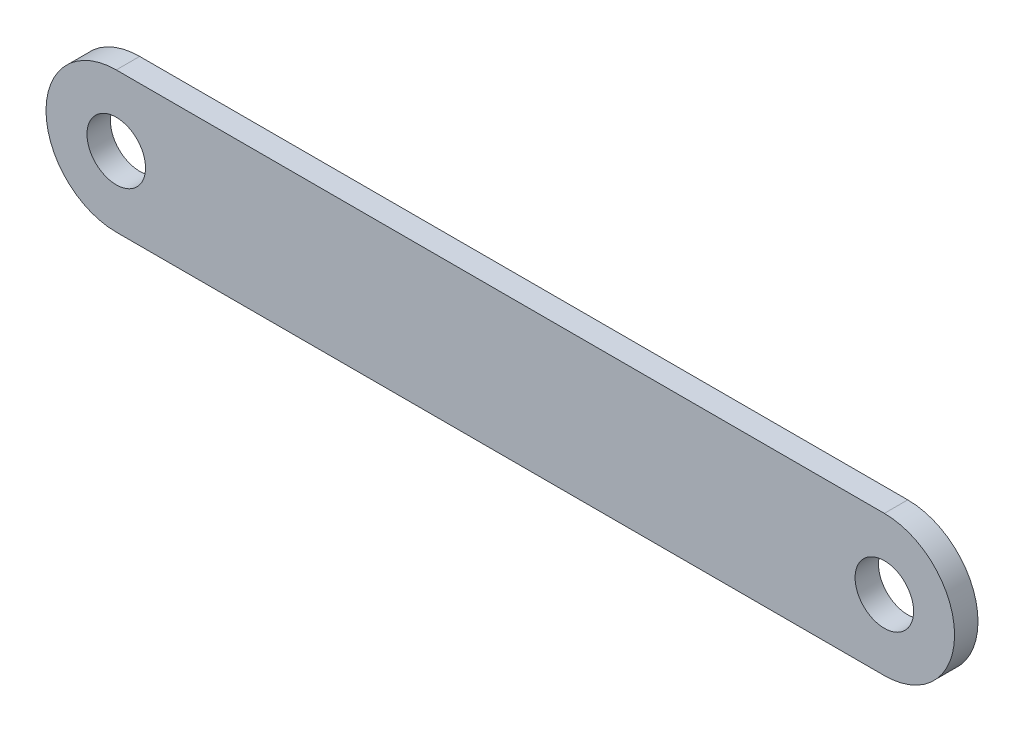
ISO-10303-21;
HEADER;
FILE_DESCRIPTION(('STEP AP214'),'2;1');
FILE_NAME('part.step','',(''),(''),'','','');
FILE_SCHEMA(('AUTOMOTIVE_DESIGN { 1 0 10303 214 1 1 1 1 }'));
ENDSEC;
DATA;
#1=APPLICATION_CONTEXT('core data for automotive mechanical design processes');
#2=APPLICATION_PROTOCOL_DEFINITION('international standard','automotive_design',2000,#1);
#3=PRODUCT_CONTEXT('',#1,'mechanical');
#4=PRODUCT('Part','Part','',(#3));
#5=PRODUCT_RELATED_PRODUCT_CATEGORY('part','',(#4));
#6=PRODUCT_DEFINITION_FORMATION('','',#4);
#7=PRODUCT_DEFINITION_CONTEXT('part definition',#1,'design');
#8=PRODUCT_DEFINITION('design','',#6,#7);
#9=PRODUCT_DEFINITION_SHAPE('','',#8);
#10=(LENGTH_UNIT() NAMED_UNIT(*) SI_UNIT(.MILLI.,.METRE.));
#11=(NAMED_UNIT(*) PLANE_ANGLE_UNIT() SI_UNIT($,.RADIAN.));
#12=(NAMED_UNIT(*) SI_UNIT($,.STERADIAN.) SOLID_ANGLE_UNIT());
#13=UNCERTAINTY_MEASURE_WITH_UNIT(LENGTH_MEASURE(1.E-05),#10,'distance_accuracy_value','');
#14=(GEOMETRIC_REPRESENTATION_CONTEXT(3) GLOBAL_UNCERTAINTY_ASSIGNED_CONTEXT((#13)) GLOBAL_UNIT_ASSIGNED_CONTEXT((#10,
#11,#12)) REPRESENTATION_CONTEXT('',''));
#15=CARTESIAN_POINT('',(0.,0.,0.));
#16=DIRECTION('',(0.,0.,1.));
#17=DIRECTION('',(1.,0.,0.));
#18=AXIS2_PLACEMENT_3D('',#15,#16,#17);
#19=CARTESIAN_POINT('',(0.,0.,2.54));
#20=DIRECTION('',(0.,0.,1.));
#21=DIRECTION('',(1.,0.,0.));
#22=AXIS2_PLACEMENT_3D('',#19,#20,#21);
#23=PLANE('',#22);
#24=CARTESIAN_POINT('',(0.,0.,2.54));
#25=DIRECTION('',(0.,0.,1.));
#26=DIRECTION('',(1.,0.,0.));
#27=AXIS2_PLACEMENT_3D('',#24,#25,#26);
#28=CIRCLE('',#27,3.175);
#29=CARTESIAN_POINT('',(3.175,0.,2.54));
#30=VERTEX_POINT('',#29);
#31=EDGE_CURVE('E99',#30,#30,#28,.T.);
#32=ORIENTED_EDGE('',*,*,#31,.F.);
#33=EDGE_LOOP('',(#32));
#34=FACE_BOUND('',#33,.T.);
#35=CARTESIAN_POINT('',(0.,0.,2.54));
#36=DIRECTION('',(0.,0.,1.));
#37=DIRECTION('',(1.,0.,0.));
#38=AXIS2_PLACEMENT_3D('',#35,#36,#37);
#39=CIRCLE('',#38,7.62);
#40=CARTESIAN_POINT('',(0.,7.62,2.54));
#41=VERTEX_POINT('',#40);
#42=CARTESIAN_POINT('',(0.,-7.62,2.54));
#43=VERTEX_POINT('',#42);
#44=EDGE_CURVE('E84',#41,#43,#39,.T.);
#45=ORIENTED_EDGE('',*,*,#44,.T.);
#46=DIRECTION('',(1.,0.,0.));
#47=VECTOR('',#46,1.);
#48=CARTESIAN_POINT('',(0.,-7.62,2.54));
#49=LINE('',#48,#47);
#50=CARTESIAN_POINT('',(83.312,-7.62,2.54));
#51=VERTEX_POINT('',#50);
#52=EDGE_CURVE('E79',#43,#51,#49,.T.);
#53=ORIENTED_EDGE('',*,*,#52,.T.);
#54=CARTESIAN_POINT('',(83.312,0.,2.54));
#55=DIRECTION('',(0.,0.,1.));
#56=DIRECTION('',(-1.,0.,0.));
#57=AXIS2_PLACEMENT_3D('',#54,#55,#56);
#58=CIRCLE('',#57,7.62);
#59=CARTESIAN_POINT('',(83.312,7.62,2.54));
#60=VERTEX_POINT('',#59);
#61=EDGE_CURVE('E82',#51,#60,#58,.T.);
#62=ORIENTED_EDGE('',*,*,#61,.T.);
#63=DIRECTION('',(-1.,0.,0.));
#64=VECTOR('',#63,1.);
#65=CARTESIAN_POINT('',(0.,7.62,2.54));
#66=LINE('',#65,#64);
#67=EDGE_CURVE('E49',#60,#41,#66,.T.);
#68=ORIENTED_EDGE('',*,*,#67,.T.);
#69=EDGE_LOOP('',(#45,#53,#62,#68));
#70=FACE_BOUND('',#69,.T.);
#71=CARTESIAN_POINT('',(83.312,0.,2.54));
#72=DIRECTION('',(0.,0.,1.));
#73=DIRECTION('',(1.,0.,0.));
#74=AXIS2_PLACEMENT_3D('',#71,#72,#73);
#75=CIRCLE('',#74,3.175);
#76=CARTESIAN_POINT('',(86.487,0.,2.54));
#77=VERTEX_POINT('',#76);
#78=EDGE_CURVE('E114',#77,#77,#75,.T.);
#79=ORIENTED_EDGE('',*,*,#78,.F.);
#80=EDGE_LOOP('',(#79));
#81=FACE_BOUND('',#80,.T.);
#82=ADVANCED_FACE('F32',(#34,#70,#81),#23,.T.);
#83=CARTESIAN_POINT('',(0.,0.,0.));
#84=DIRECTION('',(0.,0.,1.));
#85=DIRECTION('',(1.,0.,0.));
#86=AXIS2_PLACEMENT_3D('',#83,#84,#85);
#87=PLANE('',#86);
#88=CARTESIAN_POINT('',(0.,0.,0.));
#89=DIRECTION('',(0.,0.,1.));
#90=DIRECTION('',(1.,0.,0.));
#91=AXIS2_PLACEMENT_3D('',#88,#89,#90);
#92=CIRCLE('',#91,3.175);
#93=CARTESIAN_POINT('',(3.175,0.,0.));
#94=VERTEX_POINT('',#93);
#95=EDGE_CURVE('E111',#94,#94,#92,.T.);
#96=ORIENTED_EDGE('',*,*,#95,.T.);
#97=EDGE_LOOP('',(#96));
#98=FACE_BOUND('',#97,.T.);
#99=CARTESIAN_POINT('',(0.,0.,0.));
#100=DIRECTION('',(0.,0.,1.));
#101=DIRECTION('',(1.,0.,0.));
#102=AXIS2_PLACEMENT_3D('',#99,#100,#101);
#103=CIRCLE('',#102,7.62);
#104=CARTESIAN_POINT('',(0.,7.62,0.));
#105=VERTEX_POINT('',#104);
#106=CARTESIAN_POINT('',(0.,-7.62,0.));
#107=VERTEX_POINT('',#106);
#108=EDGE_CURVE('E96',#105,#107,#103,.T.);
#109=ORIENTED_EDGE('',*,*,#108,.F.);
#110=DIRECTION('',(-1.,0.,0.));
#111=VECTOR('',#110,1.);
#112=CARTESIAN_POINT('',(0.,7.62,0.));
#113=LINE('',#112,#111);
#114=CARTESIAN_POINT('',(83.312,7.62,0.));
#115=VERTEX_POINT('',#114);
#116=EDGE_CURVE('E72',#115,#105,#113,.T.);
#117=ORIENTED_EDGE('',*,*,#116,.F.);
#118=CARTESIAN_POINT('',(83.312,0.,0.));
#119=DIRECTION('',(0.,0.,1.));
#120=DIRECTION('',(-1.,0.,0.));
#121=AXIS2_PLACEMENT_3D('',#118,#119,#120);
#122=CIRCLE('',#121,7.62);
#123=CARTESIAN_POINT('',(83.312,-7.62,0.));
#124=VERTEX_POINT('',#123);
#125=EDGE_CURVE('E66',#124,#115,#122,.T.);
#126=ORIENTED_EDGE('',*,*,#125,.F.);
#127=DIRECTION('',(1.,0.,0.));
#128=VECTOR('',#127,1.);
#129=CARTESIAN_POINT('',(0.,-7.62,0.));
#130=LINE('',#129,#128);
#131=EDGE_CURVE('E88',#107,#124,#130,.T.);
#132=ORIENTED_EDGE('',*,*,#131,.F.);
#133=EDGE_LOOP('',(#109,#117,#126,#132));
#134=FACE_BOUND('',#133,.T.);
#135=CARTESIAN_POINT('',(83.312,0.,0.));
#136=DIRECTION('',(0.,0.,1.));
#137=DIRECTION('',(1.,0.,0.));
#138=AXIS2_PLACEMENT_3D('',#135,#136,#137);
#139=CIRCLE('',#138,3.175);
#140=CARTESIAN_POINT('',(86.487,0.,0.));
#141=VERTEX_POINT('',#140);
#142=EDGE_CURVE('E117',#141,#141,#139,.T.);
#143=ORIENTED_EDGE('',*,*,#142,.T.);
#144=EDGE_LOOP('',(#143));
#145=FACE_BOUND('',#144,.T.);
#146=ADVANCED_FACE('F107',(#98,#134,#145),#87,.F.);
#147=CARTESIAN_POINT('',(0.,0.,2.54));
#148=DIRECTION('',(0.,0.,-1.));
#149=DIRECTION('',(-1.,0.,0.));
#150=AXIS2_PLACEMENT_3D('',#147,#148,#149);
#151=CYLINDRICAL_SURFACE('',#150,7.62);
#152=ORIENTED_EDGE('',*,*,#108,.T.);
#153=DIRECTION('',(0.,0.,-1.));
#154=VECTOR('',#153,1.);
#155=CARTESIAN_POINT('',(0.,-7.62,2.54));
#156=LINE('',#155,#154);
#157=EDGE_CURVE('E11',#43,#107,#156,.T.);
#158=ORIENTED_EDGE('',*,*,#157,.F.);
#159=ORIENTED_EDGE('',*,*,#44,.F.);
#160=DIRECTION('',(0.,0.,-1.));
#161=VECTOR('',#160,1.);
#162=CARTESIAN_POINT('',(0.,7.62,2.54));
#163=LINE('',#162,#161);
#164=EDGE_CURVE('E92',#41,#105,#163,.T.);
#165=ORIENTED_EDGE('',*,*,#164,.T.);
#166=EDGE_LOOP('',(#152,#158,#159,#165));
#167=FACE_BOUND('',#166,.T.);
#168=ADVANCED_FACE('F34',(#167),#151,.T.);
#169=CARTESIAN_POINT('',(0.,-7.62,2.54));
#170=DIRECTION('',(0.,1.,0.));
#171=DIRECTION('',(0.,0.,1.));
#172=AXIS2_PLACEMENT_3D('',#169,#170,#171);
#173=PLANE('',#172);
#174=ORIENTED_EDGE('',*,*,#131,.T.);
#175=DIRECTION('',(0.,0.,-1.));
#176=VECTOR('',#175,1.);
#177=CARTESIAN_POINT('',(83.312,-7.62,2.54));
#178=LINE('',#177,#176);
#179=EDGE_CURVE('E41',#51,#124,#178,.T.);
#180=ORIENTED_EDGE('',*,*,#179,.F.);
#181=ORIENTED_EDGE('',*,*,#52,.F.);
#182=ORIENTED_EDGE('',*,*,#157,.T.);
#183=EDGE_LOOP('',(#174,#180,#181,#182));
#184=FACE_BOUND('',#183,.T.);
#185=ADVANCED_FACE('F87',(#184),#173,.F.);
#186=CARTESIAN_POINT('',(83.312,0.,2.54));
#187=DIRECTION('',(0.,0.,-1.));
#188=DIRECTION('',(-1.,0.,0.));
#189=AXIS2_PLACEMENT_3D('',#186,#187,#188);
#190=CYLINDRICAL_SURFACE('',#189,7.62);
#191=ORIENTED_EDGE('',*,*,#125,.T.);
#192=DIRECTION('',(0.,0.,-1.));
#193=VECTOR('',#192,1.);
#194=CARTESIAN_POINT('',(83.312,7.62,2.54));
#195=LINE('',#194,#193);
#196=EDGE_CURVE('E89',#60,#115,#195,.T.);
#197=ORIENTED_EDGE('',*,*,#196,.F.);
#198=ORIENTED_EDGE('',*,*,#61,.F.);
#199=ORIENTED_EDGE('',*,*,#179,.T.);
#200=EDGE_LOOP('',(#191,#197,#198,#199));
#201=FACE_BOUND('',#200,.T.);
#202=ADVANCED_FACE('F90',(#201),#190,.T.);
#203=CARTESIAN_POINT('',(0.,7.62,2.54));
#204=DIRECTION('',(0.,-1.,0.));
#205=DIRECTION('',(0.,0.,-1.));
#206=AXIS2_PLACEMENT_3D('',#203,#204,#205);
#207=PLANE('',#206);
#208=ORIENTED_EDGE('',*,*,#116,.T.);
#209=ORIENTED_EDGE('',*,*,#164,.F.);
#210=ORIENTED_EDGE('',*,*,#67,.F.);
#211=ORIENTED_EDGE('',*,*,#196,.T.);
#212=EDGE_LOOP('',(#208,#209,#210,#211));
#213=FACE_BOUND('',#212,.T.);
#214=ADVANCED_FACE('F104',(#213),#207,.F.);
#215=CARTESIAN_POINT('',(0.,0.,2.54));
#216=DIRECTION('',(0.,0.,-1.));
#217=DIRECTION('',(-1.,0.,0.));
#218=AXIS2_PLACEMENT_3D('',#215,#216,#217);
#219=CYLINDRICAL_SURFACE('',#218,3.175);
#220=ORIENTED_EDGE('',*,*,#31,.T.);
#221=EDGE_LOOP('',(#220));
#222=FACE_BOUND('',#221,.T.);
#223=ORIENTED_EDGE('',*,*,#95,.F.);
#224=EDGE_LOOP('',(#223));
#225=FACE_BOUND('',#224,.T.);
#226=ADVANCED_FACE('F135',(#222,#225),#219,.F.);
#227=CARTESIAN_POINT('',(83.312,0.,2.54));
#228=DIRECTION('',(0.,0.,-1.));
#229=DIRECTION('',(-1.,0.,0.));
#230=AXIS2_PLACEMENT_3D('',#227,#228,#229);
#231=CYLINDRICAL_SURFACE('',#230,3.175);
#232=ORIENTED_EDGE('',*,*,#78,.T.);
#233=EDGE_LOOP('',(#232));
#234=FACE_BOUND('',#233,.T.);
#235=ORIENTED_EDGE('',*,*,#142,.F.);
#236=EDGE_LOOP('',(#235));
#237=FACE_BOUND('',#236,.T.);
#238=ADVANCED_FACE('F123',(#234,#237),#231,.F.);
#239=CLOSED_SHELL('',(#82,#146,#168,#185,#202,#214,#226,#238));
#240=MANIFOLD_SOLID_BREP('B2',#239);
#241=ADVANCED_BREP_SHAPE_REPRESENTATION('',(#18,#240),#14);
#242=SHAPE_DEFINITION_REPRESENTATION(#9,#241);
ENDSEC;
END-ISO-10303-21;
